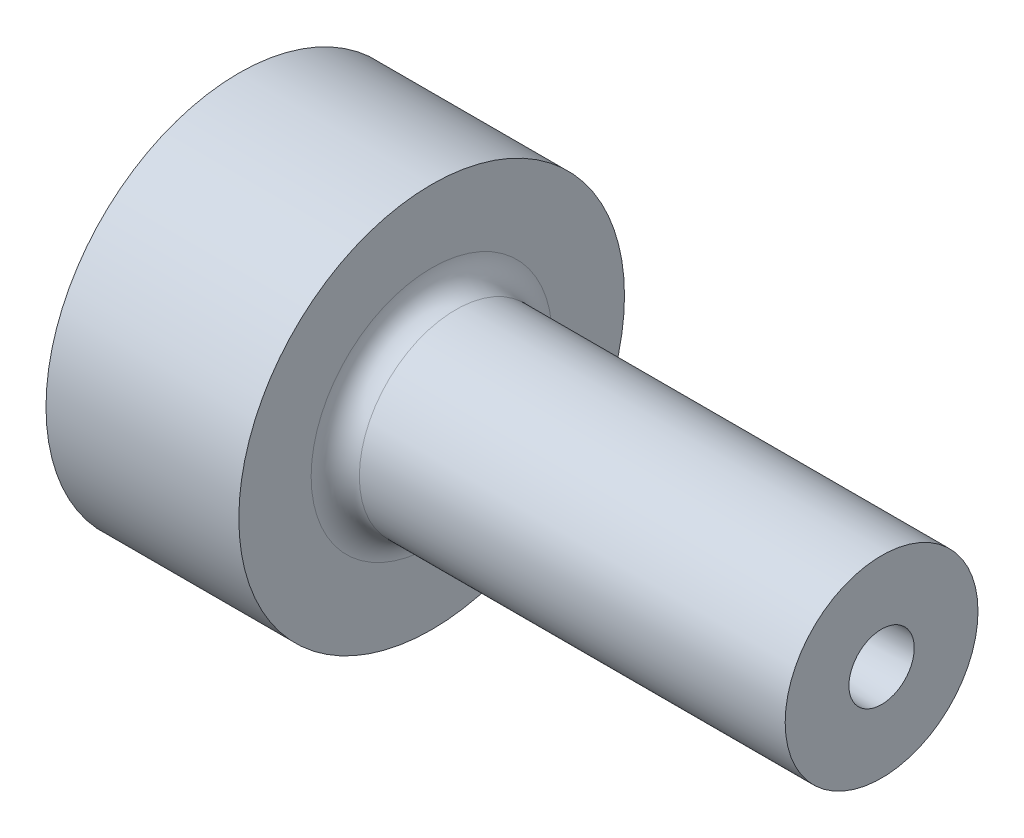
ISO-10303-21;
HEADER;
FILE_DESCRIPTION(('STEP AP214'),'2;1');
FILE_NAME('part.step','',(''),(''),'','','');
FILE_SCHEMA(('AUTOMOTIVE_DESIGN { 1 0 10303 214 1 1 1 1 }'));
ENDSEC;
DATA;
#1=APPLICATION_CONTEXT('core data for automotive mechanical design processes');
#2=APPLICATION_PROTOCOL_DEFINITION('international standard','automotive_design',2000,#1);
#3=PRODUCT_CONTEXT('',#1,'mechanical');
#4=PRODUCT('Part','Part','',(#3));
#5=PRODUCT_RELATED_PRODUCT_CATEGORY('part','',(#4));
#6=PRODUCT_DEFINITION_FORMATION('','',#4);
#7=PRODUCT_DEFINITION_CONTEXT('part definition',#1,'design');
#8=PRODUCT_DEFINITION('design','',#6,#7);
#9=PRODUCT_DEFINITION_SHAPE('','',#8);
#10=(LENGTH_UNIT() NAMED_UNIT(*) SI_UNIT(.MILLI.,.METRE.));
#11=(NAMED_UNIT(*) PLANE_ANGLE_UNIT() SI_UNIT($,.RADIAN.));
#12=(NAMED_UNIT(*) SI_UNIT($,.STERADIAN.) SOLID_ANGLE_UNIT());
#13=UNCERTAINTY_MEASURE_WITH_UNIT(LENGTH_MEASURE(1.E-05),#10,'distance_accuracy_value','');
#14=(GEOMETRIC_REPRESENTATION_CONTEXT(3) GLOBAL_UNCERTAINTY_ASSIGNED_CONTEXT((#13)) GLOBAL_UNIT_ASSIGNED_CONTEXT((#10,
#11,#12)) REPRESENTATION_CONTEXT('',''));
#15=CARTESIAN_POINT('',(0.,0.,0.));
#16=DIRECTION('',(0.,0.,1.));
#17=DIRECTION('',(1.,0.,0.));
#18=AXIS2_PLACEMENT_3D('',#15,#16,#17);
#19=CARTESIAN_POINT('',(0.,0.,0.));
#20=DIRECTION('',(-1.,0.,0.));
#21=DIRECTION('',(0.,0.,1.));
#22=AXIS2_PLACEMENT_3D('',#19,#20,#21);
#23=CYLINDRICAL_SURFACE('',#22,24.);
#24=CARTESIAN_POINT('',(24.,0.,0.));
#25=DIRECTION('',(-1.,0.,0.));
#26=DIRECTION('',(0.,0.,1.));
#27=AXIS2_PLACEMENT_3D('',#24,#25,#26);
#28=CIRCLE('',#27,24.);
#29=CARTESIAN_POINT('',(24.,0.,24.));
#30=VERTEX_POINT('',#29);
#31=EDGE_CURVE('E91',#30,#30,#28,.T.);
#32=ORIENTED_EDGE('',*,*,#31,.T.);
#33=EDGE_LOOP('',(#32));
#34=FACE_BOUND('',#33,.T.);
#35=CARTESIAN_POINT('',(0.,0.,0.));
#36=DIRECTION('',(-1.,0.,0.));
#37=DIRECTION('',(0.,0.,1.));
#38=AXIS2_PLACEMENT_3D('',#35,#36,#37);
#39=CIRCLE('',#38,24.);
#40=CARTESIAN_POINT('',(0.,0.,24.));
#41=VERTEX_POINT('',#40);
#42=EDGE_CURVE('E85',#41,#41,#39,.T.);
#43=ORIENTED_EDGE('',*,*,#42,.F.);
#44=EDGE_LOOP('',(#43));
#45=FACE_BOUND('',#44,.T.);
#46=CARTESIAN_POINT('',(12.,-23.9165214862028,-2.));
#47=CARTESIAN_POINT('',(12.1121314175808,-23.9165225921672,-1.99999510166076));
#48=CARTESIAN_POINT('',(12.2243391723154,-23.9173185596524,-1.99053818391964));
#49=CARTESIAN_POINT('',(12.4456500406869,-23.9204163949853,-1.95295195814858));
#50=CARTESIAN_POINT('',(12.5547494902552,-23.9227199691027,-1.92480149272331));
#51=CARTESIAN_POINT('',(12.7666063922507,-23.9285703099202,-1.85064796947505));
#52=CARTESIAN_POINT('',(12.8693674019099,-23.9321163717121,-1.80465503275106));
#53=CARTESIAN_POINT('',(13.0656863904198,-23.9400512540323,-1.69614013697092));
#54=CARTESIAN_POINT('',(13.1592463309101,-23.944439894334,-1.63362171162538));
#55=CARTESIAN_POINT('',(13.3347720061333,-23.9535780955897,-1.49365707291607));
#56=CARTESIAN_POINT('',(13.4167108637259,-23.9583284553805,-1.41617720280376));
#57=CARTESIAN_POINT('',(13.566437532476,-23.9676475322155,-1.24856024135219));
#58=CARTESIAN_POINT('',(13.6342247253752,-23.9722162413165,-1.15842259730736));
#59=CARTESIAN_POINT('',(13.7538132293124,-23.9806648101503,-0.967888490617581));
#60=CARTESIAN_POINT('',(13.8055912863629,-23.9845436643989,-0.867477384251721));
#61=CARTESIAN_POINT('',(13.891542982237,-23.9911668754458,-0.659348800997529));
#62=CARTESIAN_POINT('',(13.9257169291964,-23.9939112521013,-0.551631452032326));
#63=CARTESIAN_POINT('',(13.9754129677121,-23.9979507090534,-0.332215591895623));
#64=CARTESIAN_POINT('',(13.9909785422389,-23.999249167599,-0.220526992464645));
#65=CARTESIAN_POINT('',(14.0031504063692,-24.0002619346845,0.00388456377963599));
#66=CARTESIAN_POINT('',(13.9997570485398,-23.9999762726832,0.116607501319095));
#67=CARTESIAN_POINT('',(13.9741429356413,-23.9978557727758,0.339593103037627));
#68=CARTESIAN_POINT('',(13.9519689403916,-23.9960247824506,0.449861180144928));
#69=CARTESIAN_POINT('',(13.8894956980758,-23.9910239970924,0.665104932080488));
#70=CARTESIAN_POINT('',(13.8491962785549,-23.9878541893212,0.770080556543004));
#71=CARTESIAN_POINT('',(13.7515640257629,-23.9805257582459,0.971908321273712));
#72=CARTESIAN_POINT('',(13.6942102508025,-23.9763659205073,1.06875028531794));
#73=CARTESIAN_POINT('',(13.5641125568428,-23.967524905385,1.25145067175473));
#74=CARTESIAN_POINT('',(13.4913683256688,-23.9628437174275,1.33730887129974));
#75=CARTESIAN_POINT('',(13.3322911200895,-23.9534692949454,1.49587792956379));
#76=CARTESIAN_POINT('',(13.2459175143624,-23.9487760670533,1.56854803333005));
#77=CARTESIAN_POINT('',(13.0621749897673,-23.9399208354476,1.69836319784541));
#78=CARTESIAN_POINT('',(12.9648060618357,-23.9357588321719,1.75550824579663));
#79=CARTESIAN_POINT('',(12.7618082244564,-23.9284365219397,1.85264960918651));
#80=CARTESIAN_POINT('',(12.6561782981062,-23.9252763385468,1.8926438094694));
#81=CARTESIAN_POINT('',(12.439670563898,-23.9203178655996,1.95431801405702));
#82=CARTESIAN_POINT('',(12.3287928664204,-23.9185195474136,1.9759984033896));
#83=CARTESIAN_POINT('',(12.1052936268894,-23.9164930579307,2.00037796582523));
#84=CARTESIAN_POINT('',(11.9926783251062,-23.9162601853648,2.00313397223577));
#85=CARTESIAN_POINT('',(11.7685873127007,-23.9173785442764,1.98973541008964));
#86=CARTESIAN_POINT('',(11.6571115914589,-23.9187297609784,1.97358101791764));
#87=CARTESIAN_POINT('',(11.4386272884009,-23.922859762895,1.92286760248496));
#88=CARTESIAN_POINT('',(11.3316125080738,-23.9256364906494,1.8883351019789));
#89=CARTESIAN_POINT('',(11.1248958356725,-23.9323029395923,1.80187268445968));
#90=CARTESIAN_POINT('',(11.0251940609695,-23.9361926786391,1.74994248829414));
#91=CARTESIAN_POINT('',(10.8356734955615,-23.9446582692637,1.6300149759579));
#92=CARTESIAN_POINT('',(10.7458787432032,-23.9492357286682,1.56197978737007));
#93=CARTESIAN_POINT('',(10.5789641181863,-23.9585555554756,1.41182825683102));
#94=CARTESIAN_POINT('',(10.5018444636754,-23.9632979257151,1.32971167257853));
#95=CARTESIAN_POINT('',(10.3622751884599,-23.9724272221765,1.15348274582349));
#96=CARTESIAN_POINT('',(10.2998624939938,-23.9768132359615,1.05934110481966));
#97=CARTESIAN_POINT('',(10.1917321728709,-23.9847224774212,0.861880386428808));
#98=CARTESIAN_POINT('',(10.1460143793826,-23.9882457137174,0.758561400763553));
#99=CARTESIAN_POINT('',(10.0726350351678,-23.994028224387,0.545811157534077));
#100=CARTESIAN_POINT('',(10.0449506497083,-23.9962890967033,0.436387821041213));
#101=CARTESIAN_POINT('',(10.0083493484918,-23.9992986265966,0.214426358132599));
#102=CARTESIAN_POINT('',(9.99943207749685,-24.0000473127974,0.101888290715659));
#103=CARTESIAN_POINT('',(10.000622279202,-23.9999481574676,-0.122744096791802));
#104=CARTESIAN_POINT('',(10.0106722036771,-23.9991051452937,-0.234838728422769));
#105=CARTESIAN_POINT('',(10.0493915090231,-23.9959268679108,-0.455742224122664));
#106=CARTESIAN_POINT('',(10.0780609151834,-23.993591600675,-0.564551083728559));
#107=CARTESIAN_POINT('',(10.1531907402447,-23.9876908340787,-0.775798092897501));
#108=CARTESIAN_POINT('',(10.1996501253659,-23.9841254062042,-0.878236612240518));
#109=CARTESIAN_POINT('',(10.3090344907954,-23.9761631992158,-1.07386914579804));
#110=CARTESIAN_POINT('',(10.3719592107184,-23.9717664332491,-1.16706330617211));
#111=CARTESIAN_POINT('',(10.5127040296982,-23.9626191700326,-1.34185617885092));
#112=CARTESIAN_POINT('',(10.5905667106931,-23.9578676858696,-1.42342055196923));
#113=CARTESIAN_POINT('',(10.7589003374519,-23.9485548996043,-1.57235565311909));
#114=CARTESIAN_POINT('',(10.8493743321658,-23.9439936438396,-1.63972293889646));
#115=CARTESIAN_POINT('',(11.0405380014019,-23.9355684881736,-1.75844275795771));
#116=CARTESIAN_POINT('',(11.1412465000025,-23.9317059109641,-1.80976504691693));
#117=CARTESIAN_POINT('',(11.3498148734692,-23.9251315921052,-1.89470580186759));
#118=CARTESIAN_POINT('',(11.4576663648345,-23.922418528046,-1.92834462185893));
#119=CARTESIAN_POINT('',(11.6384617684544,-23.9191481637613,-1.96839619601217));
#120=CARTESIAN_POINT('',(11.7102429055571,-23.9181676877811,-1.98023186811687));
#121=CARTESIAN_POINT('',(11.8546720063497,-23.916853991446,-1.99603534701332));
#122=CARTESIAN_POINT('',(11.9273199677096,-23.9165207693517,-2.0000031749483));
#123=CARTESIAN_POINT('',(12.,-23.9165214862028,-2.));
#124=B_SPLINE_CURVE_WITH_KNOTS('',3,(#46,#47,#48,#49,#50,#51,#52,#53,#54,#55,#56,#57,#58,#59,
#60,#61,#62,#63,#64,#65,#66,#67,#68,#69,#70,#71,#72,#73,#74,#75,#76,#77,#78,#79,#80,#81,#82,#83,
#84,#85,#86,#87,#88,#89,#90,#91,#92,#93,#94,#95,#96,#97,#98,#99,#100,#101,#102,#103,#104,#105,
#106,#107,#108,#109,#110,#111,#112,#113,#114,#115,#116,#117,#118,#119,#120,#121,#122,#123),
.UNSPECIFIED.,.T.,.F.,(4,2,2,2,2,2,2,2,2,2,2,2,2,2,2,2,2,2,2,2,2,2,2,2,2,2,2,2,2,2,2,2,2,2,2,2,
2,2,4),(0.,0.336128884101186,0.672638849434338,1.00895820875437,1.34520570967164,
1.68221862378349,2.01924625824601,2.35676116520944,2.69427016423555,3.03098894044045,
3.36770145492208,3.70357808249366,4.0394579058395,4.37575188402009,4.71205268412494,
5.04937568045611,5.38669895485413,5.72406381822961,6.06142158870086,6.39776576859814,
6.73410681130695,7.06996376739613,7.4058261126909,7.7424862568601,8.07915219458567,
8.41665463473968,8.75415370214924,9.09122457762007,9.42828907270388,9.76433252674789,
10.100376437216,10.4364008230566,10.7724198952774,11.1094114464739,11.4464846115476,
11.7841893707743,12.1215045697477,12.339373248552,12.5572413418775),.UNSPECIFIED.);
#125=CARTESIAN_POINT('',(12.,-23.9165214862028,-2.));
#126=VERTEX_POINT('',#125);
#127=EDGE_CURVE('E10',#126,#126,#124,.T.);
#128=ORIENTED_EDGE('',*,*,#127,.F.);
#129=EDGE_LOOP('',(#128));
#130=FACE_BOUND('',#129,.T.);
#131=ADVANCED_FACE('F16',(#34,#45,#130),#23,.T.);
#132=CARTESIAN_POINT('',(0.,0.,0.));
#133=DIRECTION('',(1.,0.,0.));
#134=DIRECTION('',(0.,0.,-1.));
#135=AXIS2_PLACEMENT_3D('',#132,#133,#134);
#136=CONICAL_SURFACE('',#135,2.25,0.0226892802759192);
#137=CARTESIAN_POINT('',(80.,0.,0.));
#138=DIRECTION('',(-1.,0.,0.));
#139=DIRECTION('',(0.,0.,1.));
#140=AXIS2_PLACEMENT_3D('',#137,#138,#139);
#141=CIRCLE('',#140,4.06545396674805);
#142=CARTESIAN_POINT('',(80.,0.,4.06545396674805));
#143=VERTEX_POINT('',#142);
#144=EDGE_CURVE('E77',#143,#143,#141,.T.);
#145=ORIENTED_EDGE('',*,*,#144,.F.);
#146=EDGE_LOOP('',(#145));
#147=FACE_BOUND('',#146,.T.);
#148=CARTESIAN_POINT('',(4.12419682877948,0.,0.));
#149=DIRECTION('',(-1.,0.,0.));
#150=DIRECTION('',(0.,0.,1.));
#151=AXIS2_PLACEMENT_3D('',#148,#149,#150);
#152=CIRCLE('',#151,2.34359111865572);
#153=CARTESIAN_POINT('',(4.12419682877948,0.,2.34359111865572));
#154=VERTEX_POINT('',#153);
#155=EDGE_CURVE('E97',#154,#154,#152,.F.);
#156=ORIENTED_EDGE('',*,*,#155,.F.);
#157=EDGE_LOOP('',(#156));
#158=FACE_BOUND('',#157,.T.);
#159=ADVANCED_FACE('F44',(#147,#158),#136,.F.);
#160=CARTESIAN_POINT('',(27.,0.,0.));
#161=DIRECTION('',(-1.,0.,0.));
#162=DIRECTION('',(0.,0.,1.));
#163=AXIS2_PLACEMENT_3D('',#160,#161,#162);
#164=TOROIDAL_SURFACE('',#163,15.,3.);
#165=CARTESIAN_POINT('',(24.,0.,0.));
#166=DIRECTION('',(-1.,0.,0.));
#167=DIRECTION('',(0.,0.,1.));
#168=AXIS2_PLACEMENT_3D('',#165,#166,#167);
#169=CIRCLE('',#168,15.);
#170=CARTESIAN_POINT('',(24.,0.,15.));
#171=VERTEX_POINT('',#170);
#172=EDGE_CURVE('E93',#171,#171,#169,.T.);
#173=ORIENTED_EDGE('',*,*,#172,.F.);
#174=EDGE_LOOP('',(#173));
#175=FACE_BOUND('',#174,.T.);
#176=CARTESIAN_POINT('',(27.,0.,0.));
#177=DIRECTION('',(-1.,0.,0.));
#178=DIRECTION('',(0.,0.,1.));
#179=AXIS2_PLACEMENT_3D('',#176,#177,#178);
#180=CIRCLE('',#179,12.);
#181=CARTESIAN_POINT('',(27.,0.,12.));
#182=VERTEX_POINT('',#181);
#183=EDGE_CURVE('E29',#182,#182,#180,.T.);
#184=ORIENTED_EDGE('',*,*,#183,.T.);
#185=EDGE_LOOP('',(#184));
#186=FACE_BOUND('',#185,.T.);
#187=ADVANCED_FACE('F18',(#175,#186),#164,.F.);
#188=CARTESIAN_POINT('',(0.,0.,0.));
#189=DIRECTION('',(-1.,0.,0.));
#190=DIRECTION('',(0.,0.,1.));
#191=AXIS2_PLACEMENT_3D('',#188,#189,#190);
#192=CYLINDRICAL_SURFACE('',#191,12.);
#193=ORIENTED_EDGE('',*,*,#183,.F.);
#194=EDGE_LOOP('',(#193));
#195=FACE_BOUND('',#194,.T.);
#196=CARTESIAN_POINT('',(80.,0.,0.));
#197=DIRECTION('',(-1.,0.,0.));
#198=DIRECTION('',(0.,0.,1.));
#199=AXIS2_PLACEMENT_3D('',#196,#197,#198);
#200=CIRCLE('',#199,12.);
#201=CARTESIAN_POINT('',(80.,0.,12.));
#202=VERTEX_POINT('',#201);
#203=EDGE_CURVE('E75',#202,#202,#200,.T.);
#204=ORIENTED_EDGE('',*,*,#203,.T.);
#205=EDGE_LOOP('',(#204));
#206=FACE_BOUND('',#205,.T.);
#207=ADVANCED_FACE('F63',(#195,#206),#192,.T.);
#208=CARTESIAN_POINT('',(80.,12.,0.));
#209=DIRECTION('',(-1.,0.,0.));
#210=DIRECTION('',(0.,0.,1.));
#211=AXIS2_PLACEMENT_3D('',#208,#209,#210);
#212=PLANE('',#211);
#213=ORIENTED_EDGE('',*,*,#203,.F.);
#214=EDGE_LOOP('',(#213));
#215=FACE_BOUND('',#214,.T.);
#216=ORIENTED_EDGE('',*,*,#144,.T.);
#217=EDGE_LOOP('',(#216));
#218=FACE_BOUND('',#217,.T.);
#219=ADVANCED_FACE('F59',(#215,#218),#212,.F.);
#220=CARTESIAN_POINT('',(0.,2.25,0.));
#221=DIRECTION('',(1.,0.,0.));
#222=DIRECTION('',(0.,0.,-1.));
#223=AXIS2_PLACEMENT_3D('',#220,#221,#222);
#224=PLANE('',#223);
#225=CARTESIAN_POINT('',(0.,0.,0.));
#226=DIRECTION('',(-1.,0.,0.));
#227=DIRECTION('',(0.,0.,1.));
#228=AXIS2_PLACEMENT_3D('',#225,#226,#227);
#229=CIRCLE('',#228,21.);
#230=CARTESIAN_POINT('',(0.,0.,21.));
#231=VERTEX_POINT('',#230);
#232=EDGE_CURVE('E101',#231,#231,#229,.T.);
#233=ORIENTED_EDGE('',*,*,#232,.F.);
#234=EDGE_LOOP('',(#233));
#235=FACE_BOUND('',#234,.T.);
#236=ORIENTED_EDGE('',*,*,#42,.T.);
#237=EDGE_LOOP('',(#236));
#238=FACE_BOUND('',#237,.T.);
#239=ADVANCED_FACE('F57',(#235,#238),#224,.F.);
#240=CARTESIAN_POINT('',(24.,24.,0.));
#241=DIRECTION('',(-1.,0.,0.));
#242=DIRECTION('',(0.,0.,1.));
#243=AXIS2_PLACEMENT_3D('',#240,#241,#242);
#244=PLANE('',#243);
#245=ORIENTED_EDGE('',*,*,#31,.F.);
#246=EDGE_LOOP('',(#245));
#247=FACE_BOUND('',#246,.T.);
#248=ORIENTED_EDGE('',*,*,#172,.T.);
#249=EDGE_LOOP('',(#248));
#250=FACE_BOUND('',#249,.T.);
#251=ADVANCED_FACE('F55',(#247,#250),#244,.F.);
#252=CARTESIAN_POINT('',(-35.8646602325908,0.,0.));
#253=DIRECTION('',(-1.,0.,0.));
#254=DIRECTION('',(0.,0.,1.));
#255=AXIS2_PLACEMENT_3D('',#252,#253,#254);
#256=DEGENERATE_TOROIDAL_SURFACE('',#255,3.28768376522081,40.,.T.);
#257=ORIENTED_EDGE('',*,*,#232,.T.);
#258=EDGE_LOOP('',(#257));
#259=FACE_BOUND('',#258,.T.);
#260=ORIENTED_EDGE('',*,*,#155,.T.);
#261=EDGE_LOOP('',(#260));
#262=FACE_BOUND('',#261,.T.);
#263=ADVANCED_FACE('F40',(#259,#262),#256,.F.);
#264=CARTESIAN_POINT('',(12.,-24.,0.));
#265=DIRECTION('',(0.,-1.,0.));
#266=DIRECTION('',(0.,0.,-1.));
#267=AXIS2_PLACEMENT_3D('',#264,#265,#266);
#268=CYLINDRICAL_SURFACE('',#267,2.);
#269=CARTESIAN_POINT('',(12.,-18.,0.));
#270=DIRECTION('',(0.,-1.,0.));
#271=DIRECTION('',(0.,0.,-1.));
#272=AXIS2_PLACEMENT_3D('',#269,#270,#271);
#273=CIRCLE('',#272,2.);
#274=CARTESIAN_POINT('',(12.,-18.,-2.));
#275=VERTEX_POINT('',#274);
#276=EDGE_CURVE('E105',#275,#275,#273,.T.);
#277=ORIENTED_EDGE('',*,*,#276,.F.);
#278=EDGE_LOOP('',(#277));
#279=FACE_BOUND('',#278,.T.);
#280=ORIENTED_EDGE('',*,*,#127,.T.);
#281=EDGE_LOOP('',(#280));
#282=FACE_BOUND('',#281,.T.);
#283=ADVANCED_FACE('F34',(#279,#282),#268,.F.);
#284=CARTESIAN_POINT('',(12.,-16.8452994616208,0.));
#285=DIRECTION('',(0.,-1.,0.));
#286=DIRECTION('',(0.,0.,-1.));
#287=AXIS2_PLACEMENT_3D('',#284,#285,#286);
#288=CONICAL_SURFACE('',#287,0.,1.0471975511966);
#289=ORIENTED_EDGE('',*,*,#276,.T.);
#290=EDGE_LOOP('',(#289));
#291=FACE_BOUND('',#290,.T.);
#292=CARTESIAN_POINT('',(12.,-16.8452994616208,0.));
#293=VERTEX_POINT('',#292);
#294=VERTEX_LOOP('',#293);
#295=FACE_BOUND('',#294,.T.);
#296=ADVANCED_FACE('F32',(#291,#295),#288,.F.);
#297=CLOSED_SHELL('',(#131,#159,#187,#207,#219,#239,#251,#263,#283,#296));
#298=MANIFOLD_SOLID_BREP('B1',#297);
#299=ADVANCED_BREP_SHAPE_REPRESENTATION('',(#18,#298),#14);
#300=SHAPE_DEFINITION_REPRESENTATION(#9,#299);
ENDSEC;
END-ISO-10303-21;
